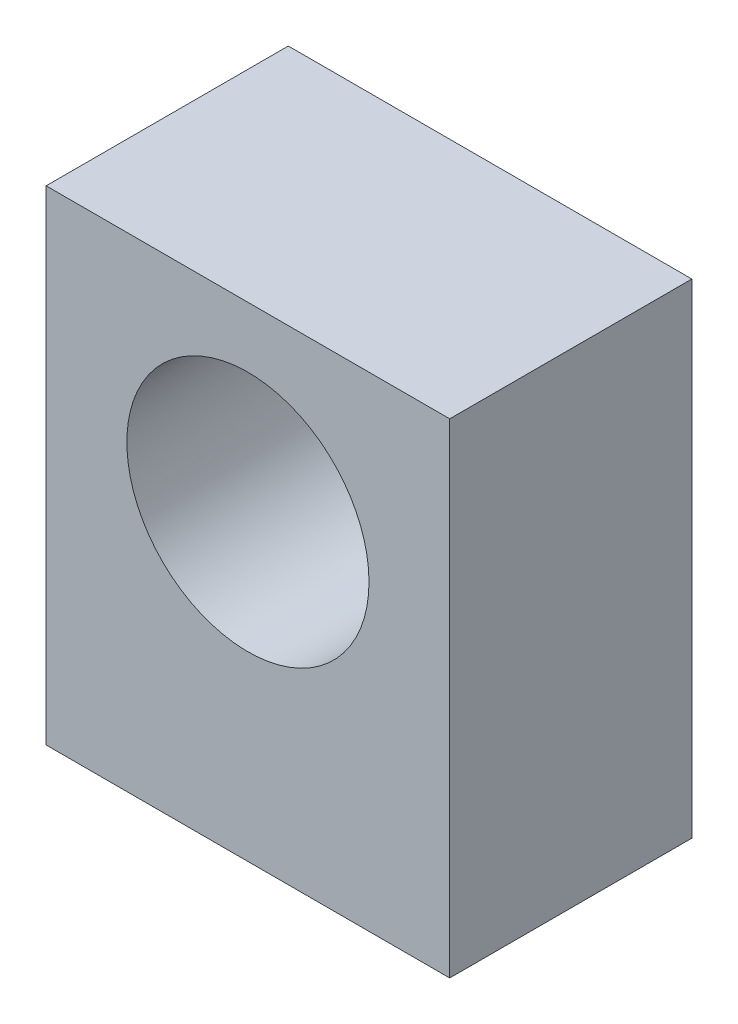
from build123d import *

# Parameters (mm, degrees)
SKETCH1_W          = 31.75
SKETCH1_H          = 38.1
BASE_EXTRUDE_DEPTH = 19.05
SKETCH2_R          = 9.525
CUT_EXTRUDE1_DEPTH = 46.459081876


with BuildPart() as part:
    # Sketch1 → Base-Extrude (new body)
    with BuildSketch(Plane.XY):
        with Locations((0, 19.05)):
            Rectangle(SKETCH1_W, SKETCH1_H)
    extrude(amount=BASE_EXTRUDE_DEPTH)

    # Sketch2 → Cut-Extrude1 (cut, through all)
    with BuildSketch(Plane.XY.offset(19.05)):
        with Locations((0, 23.8125)):
            Circle(SKETCH2_R)
    extrude(amount=-CUT_EXTRUDE1_DEPTH, mode=Mode.SUBTRACT)


solid = part.part
